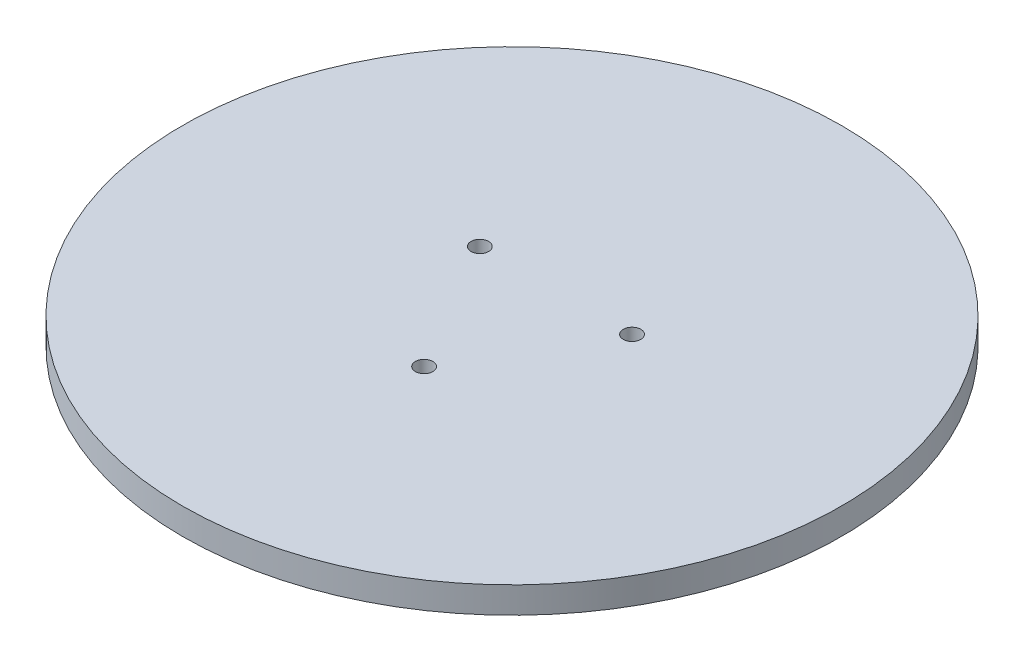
from build123d import *

# Parameters (mm, degrees)
SKETCH1_R           = 75
BOSS_EXTRUDE1_DEPTH = 6
CUT_EXTRUDE1_REACH  = 108.236
SKETCH2_R           = 2


with BuildPart() as part:
    # Sketch1 → Boss-Extrude1 (new body)
    with BuildSketch(Plane(origin=(0, 0, 0), x_dir=(1, 0, 0), z_dir=(0, 1, 0))):
        with Locations(Location((0, 0, 0), (0, 0, 270))):
            Circle(SKETCH1_R)
    extrude(amount=BOSS_EXTRUDE1_DEPTH)

    # Sketch2 → Cut-Extrude1 (cut, up to next)
    with BuildSketch(Plane.XZ, mode=Mode.PRIVATE) as cut_extrude1_sk1:
        with Locations(Location((0, 20, 0), (0, 0, 270))):
            Circle(SKETCH2_R)
    cut_extrude1_tool1 = extrude(cut_extrude1_sk1.sketch, amount=-CUT_EXTRUDE1_REACH, mode=Mode.PRIVATE) & part.part
    # Sketch2 → Cut-Extrude1 (cut, up to next)
    with BuildSketch(Plane.XZ, mode=Mode.PRIVATE) as cut_extrude1_sk2:
        with Locations(Location((17.320508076, -10, 0), (0, 0, 270))):
            Circle(SKETCH2_R)
    cut_extrude1_tool2 = extrude(cut_extrude1_sk2.sketch, amount=-CUT_EXTRUDE1_REACH, mode=Mode.PRIVATE) & part.part
    # Sketch2 → Cut-Extrude1 (cut, up to next)
    with BuildSketch(Plane.XZ, mode=Mode.PRIVATE) as cut_extrude1_sk3:
        with Locations(Location((-17.320508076, -10, 0), (0, 0, 270))):
            Circle(SKETCH2_R)
    cut_extrude1_tool3 = extrude(cut_extrude1_sk3.sketch, amount=-CUT_EXTRUDE1_REACH, mode=Mode.PRIVATE) & part.part
    add(cut_extrude1_tool1.solids().sort_by_distance((0, 0, 20))[0], mode=Mode.SUBTRACT)
    add(cut_extrude1_tool2.solids().sort_by_distance((17.320508, 0, -10))[0], mode=Mode.SUBTRACT)
    add(cut_extrude1_tool3.solids().sort_by_distance((-17.320508, 0, -10))[0], mode=Mode.SUBTRACT)


solid = part.part
